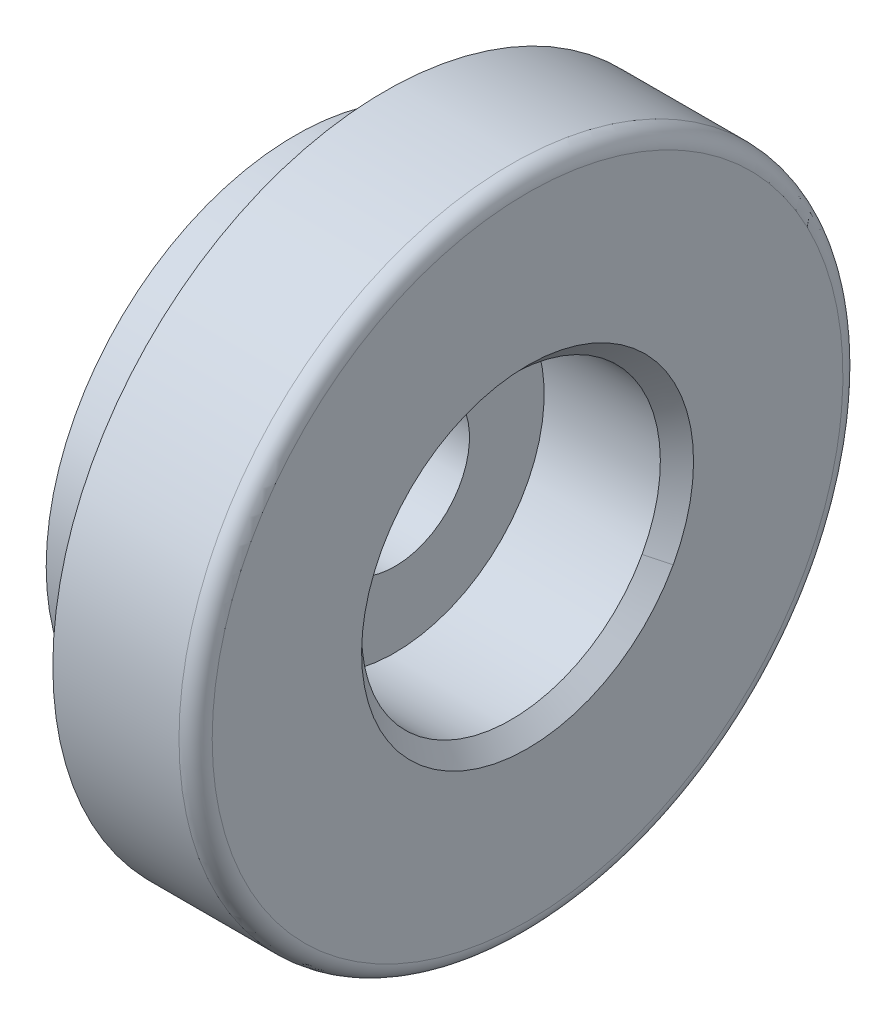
ISO-10303-21;
HEADER;
FILE_DESCRIPTION(('STEP AP214'),'2;1');
FILE_NAME('part.step','',(''),(''),'','','');
FILE_SCHEMA(('AUTOMOTIVE_DESIGN { 1 0 10303 214 1 1 1 1 }'));
ENDSEC;
DATA;
#1=APPLICATION_CONTEXT('core data for automotive mechanical design processes');
#2=APPLICATION_PROTOCOL_DEFINITION('international standard','automotive_design',2000,#1);
#3=PRODUCT_CONTEXT('',#1,'mechanical');
#4=PRODUCT('Part','Part','',(#3));
#5=PRODUCT_RELATED_PRODUCT_CATEGORY('part','',(#4));
#6=PRODUCT_DEFINITION_FORMATION('','',#4);
#7=PRODUCT_DEFINITION_CONTEXT('part definition',#1,'design');
#8=PRODUCT_DEFINITION('design','',#6,#7);
#9=PRODUCT_DEFINITION_SHAPE('','',#8);
#10=(LENGTH_UNIT() NAMED_UNIT(*) SI_UNIT(.MILLI.,.METRE.));
#11=(NAMED_UNIT(*) PLANE_ANGLE_UNIT() SI_UNIT($,.RADIAN.));
#12=(NAMED_UNIT(*) SI_UNIT($,.STERADIAN.) SOLID_ANGLE_UNIT());
#13=UNCERTAINTY_MEASURE_WITH_UNIT(LENGTH_MEASURE(1.E-05),#10,'distance_accuracy_value','');
#14=(GEOMETRIC_REPRESENTATION_CONTEXT(3) GLOBAL_UNCERTAINTY_ASSIGNED_CONTEXT((#13)) GLOBAL_UNIT_ASSIGNED_CONTEXT((#10,
#11,#12)) REPRESENTATION_CONTEXT('',''));
#15=CARTESIAN_POINT('',(0.,0.,0.));
#16=DIRECTION('',(0.,0.,1.));
#17=DIRECTION('',(1.,0.,0.));
#18=AXIS2_PLACEMENT_3D('',#15,#16,#17);
#19=CARTESIAN_POINT('',(0.,0.,2.25));
#20=DIRECTION('',(-1.,0.,0.));
#21=DIRECTION('',(0.,0.,1.));
#22=AXIS2_PLACEMENT_3D('',#19,#20,#21);
#23=PLANE('',#22);
#24=CARTESIAN_POINT('',(0.,0.,0.));
#25=DIRECTION('',(-1.,0.,0.));
#26=DIRECTION('',(0.,0.,1.));
#27=AXIS2_PLACEMENT_3D('',#24,#25,#26);
#28=CIRCLE('',#27,2.25);
#29=CARTESIAN_POINT('',(0.,0.,2.25));
#30=VERTEX_POINT('',#29);
#31=EDGE_CURVE('E180',#30,#30,#28,.F.);
#32=ORIENTED_EDGE('',*,*,#31,.T.);
#33=EDGE_LOOP('',(#32));
#34=FACE_BOUND('',#33,.T.);
#35=CARTESIAN_POINT('',(0.,0.,0.));
#36=DIRECTION('',(-1.,0.,0.));
#37=DIRECTION('',(0.,0.,1.));
#38=AXIS2_PLACEMENT_3D('',#35,#36,#37);
#39=CIRCLE('',#38,7.5);
#40=CARTESIAN_POINT('',(0.,0.,7.5));
#41=VERTEX_POINT('',#40);
#42=EDGE_CURVE('E183',#41,#41,#39,.F.);
#43=ORIENTED_EDGE('',*,*,#42,.F.);
#44=EDGE_LOOP('',(#43));
#45=FACE_BOUND('',#44,.T.);
#46=ADVANCED_FACE('F16',(#34,#45),#23,.T.);
#47=CARTESIAN_POINT('',(3.50000000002,0.,0.));
#48=DIRECTION('',(-1.,0.,0.));
#49=DIRECTION('',(0.,0.,1.));
#50=AXIS2_PLACEMENT_3D('',#47,#48,#49);
#51=CYLINDRICAL_SURFACE('',#50,7.5);
#52=CARTESIAN_POINT('',(2.7,0.,0.));
#53=DIRECTION('',(-1.,0.,0.));
#54=DIRECTION('',(0.,0.,1.));
#55=AXIS2_PLACEMENT_3D('',#52,#53,#54);
#56=CIRCLE('',#55,7.5);
#57=CARTESIAN_POINT('',(2.7,0.,7.5));
#58=VERTEX_POINT('',#57);
#59=EDGE_CURVE('E177',#58,#58,#56,.F.);
#60=ORIENTED_EDGE('',*,*,#59,.F.);
#61=EDGE_LOOP('',(#60));
#62=FACE_BOUND('',#61,.T.);
#63=ORIENTED_EDGE('',*,*,#42,.T.);
#64=EDGE_LOOP('',(#63));
#65=FACE_BOUND('',#64,.T.);
#66=ADVANCED_FACE('F104',(#62,#65),#51,.T.);
#67=CARTESIAN_POINT('',(3.50000000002,0.,0.));
#68=DIRECTION('',(-1.,0.,0.));
#69=DIRECTION('',(0.,0.,1.));
#70=AXIS2_PLACEMENT_3D('',#67,#68,#69);
#71=CYLINDRICAL_SURFACE('',#70,2.25);
#72=ORIENTED_EDGE('',*,*,#31,.F.);
#73=EDGE_LOOP('',(#72));
#74=FACE_BOUND('',#73,.T.);
#75=CARTESIAN_POINT('',(3.,0.,0.));
#76=DIRECTION('',(-1.,0.,0.));
#77=DIRECTION('',(0.,0.,1.));
#78=AXIS2_PLACEMENT_3D('',#75,#76,#77);
#79=CIRCLE('',#78,2.25);
#80=CARTESIAN_POINT('',(3.,0.,2.25));
#81=VERTEX_POINT('',#80);
#82=EDGE_CURVE('E174',#81,#81,#79,.F.);
#83=ORIENTED_EDGE('',*,*,#82,.T.);
#84=EDGE_LOOP('',(#83));
#85=FACE_BOUND('',#84,.T.);
#86=ADVANCED_FACE('F101',(#74,#85),#71,.F.);
#87=CARTESIAN_POINT('',(2.7,0.,7.5));
#88=DIRECTION('',(-1.,0.,0.));
#89=DIRECTION('',(0.,0.,1.));
#90=AXIS2_PLACEMENT_3D('',#87,#88,#89);
#91=PLANE('',#90);
#92=ORIENTED_EDGE('',*,*,#59,.T.);
#93=EDGE_LOOP('',(#92));
#94=FACE_BOUND('',#93,.T.);
#95=CARTESIAN_POINT('',(2.7,0.,0.));
#96=DIRECTION('',(-1.,0.,0.));
#97=DIRECTION('',(0.,0.,1.));
#98=AXIS2_PLACEMENT_3D('',#95,#96,#97);
#99=CIRCLE('',#98,10.);
#100=CARTESIAN_POINT('',(2.7,0.,10.));
#101=VERTEX_POINT('',#100);
#102=EDGE_CURVE('E166',#101,#101,#99,.F.);
#103=ORIENTED_EDGE('',*,*,#102,.F.);
#104=EDGE_LOOP('',(#103));
#105=FACE_BOUND('',#104,.T.);
#106=ADVANCED_FACE('F97',(#94,#105),#91,.T.);
#107=CARTESIAN_POINT('',(3.,0.,4.5));
#108=DIRECTION('',(-1.,0.,0.));
#109=DIRECTION('',(0.,0.,1.));
#110=AXIS2_PLACEMENT_3D('',#107,#108,#109);
#111=PLANE('',#110);
#112=ORIENTED_EDGE('',*,*,#82,.F.);
#113=EDGE_LOOP('',(#112));
#114=FACE_BOUND('',#113,.T.);
#115=CARTESIAN_POINT('',(3.,0.,0.));
#116=DIRECTION('',(-1.,0.,0.));
#117=DIRECTION('',(0.,0.,1.));
#118=AXIS2_PLACEMENT_3D('',#115,#116,#117);
#119=CIRCLE('',#118,4.5);
#120=CARTESIAN_POINT('',(3.,0.,4.5));
#121=VERTEX_POINT('',#120);
#122=EDGE_CURVE('E162',#121,#121,#119,.F.);
#123=ORIENTED_EDGE('',*,*,#122,.T.);
#124=EDGE_LOOP('',(#123));
#125=FACE_BOUND('',#124,.T.);
#126=ADVANCED_FACE('F93',(#114,#125),#111,.F.);
#127=CARTESIAN_POINT('',(3.50000000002,0.,0.));
#128=DIRECTION('',(-1.,0.,0.));
#129=DIRECTION('',(0.,0.,1.));
#130=AXIS2_PLACEMENT_3D('',#127,#128,#129);
#131=CYLINDRICAL_SURFACE('',#130,10.);
#132=ORIENTED_EDGE('',*,*,#102,.T.);
#133=EDGE_LOOP('',(#132));
#134=FACE_BOUND('',#133,.T.);
#135=CARTESIAN_POINT('',(6.5,0.,0.));
#136=DIRECTION('',(-1.,0.,0.));
#137=DIRECTION('',(0.,-0.197689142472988,-0.980264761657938));
#138=AXIS2_PLACEMENT_3D('',#135,#136,#137);
#139=CIRCLE('',#138,10.);
#140=CARTESIAN_POINT('',(6.5,-1.97689142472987,-9.80264761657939));
#141=VERTEX_POINT('',#140);
#142=EDGE_CURVE('E159',#141,#141,#139,.F.);
#143=ORIENTED_EDGE('',*,*,#142,.F.);
#144=EDGE_LOOP('',(#143));
#145=FACE_BOUND('',#144,.T.);
#146=ADVANCED_FACE('F89',(#134,#145),#131,.T.);
#147=CARTESIAN_POINT('',(3.50000000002,0.,0.));
#148=DIRECTION('',(-1.,0.,0.));
#149=DIRECTION('',(0.,0.,1.));
#150=AXIS2_PLACEMENT_3D('',#147,#148,#149);
#151=CYLINDRICAL_SURFACE('',#150,4.5);
#152=ORIENTED_EDGE('',*,*,#122,.F.);
#153=EDGE_LOOP('',(#152));
#154=FACE_BOUND('',#153,.T.);
#155=CARTESIAN_POINT('',(6.500000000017,0.,0.));
#156=DIRECTION('',(1.,0.,0.));
#157=DIRECTION('',(0.,-0.389180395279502,-0.921161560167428));
#158=AXIS2_PLACEMENT_3D('',#155,#156,#157);
#159=CIRCLE('',#158,4.49999999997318);
#160=CARTESIAN_POINT('',(6.50000000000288,2.15741492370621,3.94912152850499));
#161=VERTEX_POINT('',#160);
#162=CARTESIAN_POINT('',(6.49999999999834,-2.15741492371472,-3.94912152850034));
#163=VERTEX_POINT('',#162);
#164=EDGE_CURVE('E140',#161,#163,#159,.T.);
#165=ORIENTED_EDGE('',*,*,#164,.T.);
#166=CARTESIAN_POINT('',(6.49999999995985,0.,0.));
#167=DIRECTION('',(1.,0.,0.));
#168=DIRECTION('',(0.,0.479425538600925,0.877582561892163));
#169=AXIS2_PLACEMENT_3D('',#166,#167,#168);
#170=CIRCLE('',#169,4.50000000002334);
#171=EDGE_CURVE('E72',#163,#161,#170,.T.);
#172=ORIENTED_EDGE('',*,*,#171,.T.);
#173=EDGE_LOOP('',(#165,#172));
#174=FACE_BOUND('',#173,.T.);
#175=ADVANCED_FACE('F84',(#154,#174),#151,.F.);
#176=CARTESIAN_POINT('',(6.5,0.,0.));
#177=DIRECTION('',(-1.,0.,0.));
#178=DIRECTION('',(0.,-0.197689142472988,-0.980264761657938));
#179=AXIS2_PLACEMENT_3D('',#176,#177,#178);
#180=TOROIDAL_SURFACE('',#179,9.5,0.5);
#181=CARTESIAN_POINT('',(7.,4.55454261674,8.33703433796));
#182=CARTESIAN_POINT('',(7.,4.69095873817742,8.26251362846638));
#183=CARTESIAN_POINT('',(7.,4.82554242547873,8.18463925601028));
#184=CARTESIAN_POINT('',(7.,5.09072827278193,8.02238315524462));
#185=CARTESIAN_POINT('',(7.,5.22133043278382,7.93800142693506));
#186=CARTESIAN_POINT('',(7.,5.47823656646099,7.76293058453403));
#187=CARTESIAN_POINT('',(7.,5.60454054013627,7.67224147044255));
#188=CARTESIAN_POINT('',(7.,5.85254656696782,7.48477522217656));
#189=CARTESIAN_POINT('',(7.,5.97424862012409,7.38799808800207));
#190=CARTESIAN_POINT('',(7.,6.21275746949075,7.18858870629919));
#191=CARTESIAN_POINT('',(7.,6.32956426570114,7.08595645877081));
#192=CARTESIAN_POINT('',(7.,6.55800124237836,6.875084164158));
#193=CARTESIAN_POINT('',(7.,6.66963142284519,6.76684411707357));
#194=CARTESIAN_POINT('',(7.,6.88744623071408,6.54501696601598));
#195=CARTESIAN_POINT('',(7.,6.99363085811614,6.43142986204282));
#196=CARTESIAN_POINT('',(7.,7.20029875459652,6.19918224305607));
#197=CARTESIAN_POINT('',(7.,7.30078202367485,6.08052172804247));
#198=CARTESIAN_POINT('',(7.,7.49580512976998,5.83841314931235));
#199=CARTESIAN_POINT('',(7.,7.59034496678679,5.71496508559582));
#200=CARTESIAN_POINT('',(7.,7.77325345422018,5.46357880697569));
#201=CARTESIAN_POINT('',(7.,7.86162210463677,5.33564059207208));
#202=CARTESIAN_POINT('',(7.,8.03197533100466,5.07558222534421));
#203=CARTESIAN_POINT('',(7.,8.11395990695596,4.94346207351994));
#204=CARTESIAN_POINT('',(7.,8.2713474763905,4.67535812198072));
#205=CARTESIAN_POINT('',(7.,8.34675046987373,4.53937432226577));
#206=CARTESIAN_POINT('',(7.,8.49079322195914,4.26387067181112));
#207=CARTESIAN_POINT('',(7.,8.55943298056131,4.12435082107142));
#208=CARTESIAN_POINT('',(7.,8.68978390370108,3.84211118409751));
#209=CARTESIAN_POINT('',(7.,8.75149506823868,3.69939139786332));
#210=CARTESIAN_POINT('',(7.,8.86784013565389,3.41109571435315));
#211=CARTESIAN_POINT('',(7.,8.92247403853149,3.26551981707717));
#212=CARTESIAN_POINT('',(7.,9.0245329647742,2.97186261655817));
#213=CARTESIAN_POINT('',(7.,9.07195798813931,2.82378131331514));
#214=CARTESIAN_POINT('',(7.,9.159484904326,2.52547004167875));
#215=CARTESIAN_POINT('',(7.,9.19958679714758,2.37524007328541));
#216=CARTESIAN_POINT('',(7.,9.27237084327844,2.07299338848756));
#217=CARTESIAN_POINT('',(7.,9.30505299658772,1.92097667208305));
#218=CARTESIAN_POINT('',(7.,9.36291882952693,1.61552271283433));
#219=CARTESIAN_POINT('',(7.,9.38810250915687,1.46208546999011));
#220=CARTESIAN_POINT('',(7.,9.43091072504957,1.1541601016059));
#221=CARTESIAN_POINT('',(7.,9.44853526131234,0.999671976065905));
#222=CARTESIAN_POINT('',(7.,9.47618273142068,0.690017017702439));
#223=CARTESIAN_POINT('',(7.,9.48620566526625,0.534850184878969));
#224=CARTESIAN_POINT('',(7.,9.49862578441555,0.224211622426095));
#225=CARTESIAN_POINT('',(7.,9.50102296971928,0.068739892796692));
#226=CARTESIAN_POINT('',(7.,9.49818581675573,-0.242133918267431));
#227=CARTESIAN_POINT('',(7.,9.49295147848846,-0.397535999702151));
#228=CARTESIAN_POINT('',(7.,9.47486388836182,-0.707896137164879));
#229=CARTESIAN_POINT('',(7.,9.46201063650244,-0.862854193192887));
#230=CARTESIAN_POINT('',(7.,9.4287161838,-1.17195297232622));
#231=CARTESIAN_POINT('',(7.,9.40827498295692,-1.32609369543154));
#232=CARTESIAN_POINT('',(7.,9.35985387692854,-1.63318647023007));
#233=CARTESIAN_POINT('',(7.,9.33187397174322,-1.78613852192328));
#234=CARTESIAN_POINT('',(7.,9.26844286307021,-2.09048547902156));
#235=CARTESIAN_POINT('',(7.,9.23299165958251,-2.24188038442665));
#236=CARTESIAN_POINT('',(7.,9.15470335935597,-2.54274832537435));
#237=CARTESIAN_POINT('',(7.,9.11186626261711,-2.69222136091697));
#238=CARTESIAN_POINT('',(7.,9.01890937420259,-2.98888546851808));
#239=CARTESIAN_POINT('',(7.,8.96878958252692,-3.13607654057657));
#240=CARTESIAN_POINT('',(7.,8.86138804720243,-3.42782212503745));
#241=CARTESIAN_POINT('',(7.,8.80410630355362,-3.57237663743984));
#242=CARTESIAN_POINT('',(7.,8.68251886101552,-3.85850085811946));
#243=CARTESIAN_POINT('',(7.,8.61821316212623,-4.00007056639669));
#244=CARTESIAN_POINT('',(7.,8.48273272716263,-4.27988412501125));
#245=CARTESIAN_POINT('',(7.,8.41155799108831,-4.41812797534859));
#246=CARTESIAN_POINT('',(7.,8.26251094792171,-4.69095677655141));
#247=CARTESIAN_POINT('',(7.,8.18463864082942,-4.8255417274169));
#248=CARTESIAN_POINT('',(7.,8.0223840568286,-5.09072850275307));
#249=CARTESIAN_POINT('',(7.,7.93800177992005,-5.22133032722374));
#250=CARTESIAN_POINT('',(7.,7.7629305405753,-5.47823621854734));
#251=CARTESIAN_POINT('',(7.,7.6722415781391,-5.60454028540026));
#252=CARTESIAN_POINT('',(7.,7.48477544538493,-5.85254638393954));
#253=CARTESIAN_POINT('',(7.,7.38799827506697,-5.9742484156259));
#254=CARTESIAN_POINT('',(7.,7.18858887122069,-6.21275725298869));
#255=CARTESIAN_POINT('',(7.,7.08595663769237,-6.32956405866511));
#256=CARTESIAN_POINT('',(7.,6.87508435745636,-6.5580010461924));
#257=CARTESIAN_POINT('',(7.,6.76684431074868,-6.66963122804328));
#258=CARTESIAN_POINT('',(7.,6.5450171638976,-6.88744604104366));
#259=CARTESIAN_POINT('',(7.,6.43143006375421,-6.99363067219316));
#260=CARTESIAN_POINT('',(7.,6.19918245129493,-7.20029857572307));
#261=CARTESIAN_POINT('',(7.,6.08052193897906,-7.30078184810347));
#262=CARTESIAN_POINT('',(7.,5.83841336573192,-7.49580496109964));
#263=CARTESIAN_POINT('',(7.,5.71496530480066,-7.5903448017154));
#264=CARTESIAN_POINT('',(7.,5.46357903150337,-7.77325329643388));
#265=CARTESIAN_POINT('',(7.,5.33564081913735,-7.86162195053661));
#266=CARTESIAN_POINT('',(7.,5.07558245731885,-8.03197518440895));
#267=CARTESIAN_POINT('',(7.,4.94346230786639,-8.11395976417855));
#268=CARTESIAN_POINT('',(7.,4.6753583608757,-8.27134734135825));
#269=CARTESIAN_POINT('',(7.,4.53937456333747,-8.34675033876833));
#270=CARTESIAN_POINT('',(7.,4.26387091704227,-8.49079309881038));
#271=CARTESIAN_POINT('',(7.,4.12435106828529,-8.55943286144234));
#272=CARTESIAN_POINT('',(7.,3.84211143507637,-8.68978379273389));
#273=CARTESIAN_POINT('',(7.,3.69939165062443,-8.75149496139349));
#274=CARTESIAN_POINT('',(7.,3.41109597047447,-8.86784003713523));
#275=CARTESIAN_POINT('',(7.,3.26552007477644,-8.92247394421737));
#276=CARTESIAN_POINT('',(7.,2.97186287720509,-9.02453287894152));
#277=CARTESIAN_POINT('',(7.,2.82378157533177,-9.07195790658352));
#278=CARTESIAN_POINT('',(7.,2.52547030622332,-9.15948483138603));
#279=CARTESIAN_POINT('',(7.,2.37524033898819,-9.19958672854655));
#280=CARTESIAN_POINT('',(7.,2.07299365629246,-9.27237078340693));
#281=CARTESIAN_POINT('',(7.,1.92097694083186,-9.30505294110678));
#282=CARTESIAN_POINT('',(7.,1.61552298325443,-9.36291878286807));
#283=CARTESIAN_POINT('',(7.,1.46208574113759,-9.38810246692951));
#284=CARTESIAN_POINT('',(7.,1.15416037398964,-9.43091069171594));
#285=CARTESIAN_POINT('',(7.,0.999672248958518,-9.44853523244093));
#286=CARTESIAN_POINT('',(7.,0.690017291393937,-9.47618271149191));
#287=CARTESIAN_POINT('',(7.,0.534850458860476,-9.48620564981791));
#288=CARTESIAN_POINT('',(7.,0.224211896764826,-9.49862577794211));
#289=CARTESIAN_POINT('',(7.,0.0687401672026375,-9.50102296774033));
#290=CARTESIAN_POINT('',(7.,-0.242133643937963,-9.49818582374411));
#291=CARTESIAN_POINT('',(7.,-0.397535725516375,-9.49295148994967));
#292=CARTESIAN_POINT('',(7.,-0.707895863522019,-9.47486390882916));
#293=CARTESIAN_POINT('',(7.,-0.862853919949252,-9.46201066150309));
#294=CARTESIAN_POINT('',(7.,-1.17195269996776,-9.42871621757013));
#295=CARTESIAN_POINT('',(7.,-1.32609342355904,-9.40827502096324));
#296=CARTESIAN_POINT('',(7.,-1.63318620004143,-9.35985392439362));
#297=CARTESIAN_POINT('',(7.,-1.78613825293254,-9.3318740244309));
#298=CARTESIAN_POINT('',(7.,-2.09048521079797,-9.26844292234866));
#299=CARTESIAN_POINT('',(7.,-2.2418801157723,-9.23299172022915));
#300=CARTESIAN_POINT('',(7.,-2.54274806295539,-9.15470343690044));
#301=CARTESIAN_POINT('',(7.,-2.69222110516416,-9.11186635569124));
#302=CARTESIAN_POINT('',(7.,-2.98888520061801,-9.01890944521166));
#303=CARTESIAN_POINT('',(7.,-3.13607625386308,-8.96878961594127));
#304=CARTESIAN_POINT('',(7.,-3.42782189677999,-8.86138820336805));
#305=CARTESIAN_POINT('',(7.,-3.57237648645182,-8.80410662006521));
#306=CARTESIAN_POINT('',(7.,-3.85850050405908,-8.68251875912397));
#307=CARTESIAN_POINT('',(7.,-4.00006993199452,-8.61821248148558));
#308=CARTESIAN_POINT('',(7.,-4.27988426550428,-8.48273364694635));
#309=CARTESIAN_POINT('',(7.,-4.4181291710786,-8.41156109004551));
#310=CARTESIAN_POINT('',(7.,-4.55454213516,-8.33703460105));
#311=B_SPLINE_CURVE_WITH_KNOTS('',3,(#181,#182,#183,#184,#185,#186,#187,#188,#189,#190,#191,
#192,#193,#194,#195,#196,#197,#198,#199,#200,#201,#202,#203,#204,#205,#206,#207,#208,#209,#210,
#211,#212,#213,#214,#215,#216,#217,#218,#219,#220,#221,#222,#223,#224,#225,#226,#227,#228,#229,
#230,#231,#232,#233,#234,#235,#236,#237,#238,#239,#240,#241,#242,#243,#244,#245,#246,#247,#248,
#249,#250,#251,#252,#253,#254,#255,#256,#257,#258,#259,#260,#261,#262,#263,#264,#265,#266,#267,
#268,#269,#270,#271,#272,#273,#274,#275,#276,#277,#278,#279,#280,#281,#282,#283,#284,#285,#286,
#287,#288,#289,#290,#291,#292,#293,#294,#295,#296,#297,#298,#299,#300,#301,#302,#303,#304,#305,
#306,#307,#308,#309,#310),.UNSPECIFIED.,.F.,.F.,(4,2,2,2,2,2,2,2,2,2,2,2,2,2,2,2,2,2,2,2,2,2,2,
2,2,2,2,2,2,2,2,2,2,2,2,2,2,2,2,2,2,2,2,2,2,2,2,2,2,2,2,2,2,2,2,2,2,2,2,2,2,2,2,2,4),(0.,
0.466283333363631,0.932566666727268,1.3988500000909,1.86513333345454,2.33141666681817,
2.79770000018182,3.26398333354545,3.73026666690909,4.19655000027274,4.66283333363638,
5.12911666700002,5.59540000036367,6.06168333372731,6.52796666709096,6.99425000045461,
7.46053333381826,7.92681666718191,8.39310000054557,8.85938333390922,9.32566666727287,
9.79195000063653,10.2582333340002,10.7245166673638,11.1908000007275,11.6570833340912,
12.1233666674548,12.5896500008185,13.0559333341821,13.5222166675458,13.9885000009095,
14.4547833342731,14.9210666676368,15.3873500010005,15.8536333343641,16.3199166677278,
16.7862000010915,17.2524833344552,17.7187666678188,18.1850500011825,18.6513333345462,
19.1176166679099,19.5839000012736,20.0501833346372,20.5164666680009,20.9827500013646,
21.4490333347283,21.915316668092,22.3816000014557,22.8478833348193,23.314166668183,
23.7804500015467,24.2467333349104,24.7130166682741,25.1793000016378,25.6455833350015,
26.1118666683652,26.5781500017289,27.0444333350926,27.5107166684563,27.97700000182,
28.4432833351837,28.9095666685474,29.3758500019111,29.8421333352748),.UNSPECIFIED.);
#312=CARTESIAN_POINT('',(7.,4.55454261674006,8.33703433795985));
#313=VERTEX_POINT('',#312);
#314=CARTESIAN_POINT('',(7.,-4.55454232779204,-8.33703449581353));
#315=VERTEX_POINT('',#314);
#316=EDGE_CURVE('E53',#313,#315,#311,.T.);
#317=ORIENTED_EDGE('',*,*,#316,.T.);
#318=CARTESIAN_POINT('',(7.,0.,0.));
#319=DIRECTION('',(-1.,0.,0.));
#320=DIRECTION('',(0.,-0.479425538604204,-0.877582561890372));
#321=AXIS2_PLACEMENT_3D('',#318,#319,#320);
#322=CIRCLE('',#321,9.50000000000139);
#323=EDGE_CURVE('E57',#315,#313,#322,.T.);
#324=ORIENTED_EDGE('',*,*,#323,.T.);
#325=EDGE_LOOP('',(#317,#324));
#326=FACE_BOUND('',#325,.T.);
#327=ORIENTED_EDGE('',*,*,#142,.T.);
#328=EDGE_LOOP('',(#327));
#329=FACE_BOUND('',#328,.T.);
#330=ADVANCED_FACE('F63',(#326,#329),#180,.T.);
#331=CARTESIAN_POINT('',(6.99999999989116,0.,0.));
#332=DIRECTION('',(1.,0.,0.));
#333=DIRECTION('',(0.,0.,-1.));
#334=AXIS2_PLACEMENT_3D('',#331,#332,#333);
#335=CONICAL_SURFACE('',#334,4.99999999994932,0.785398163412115);
#336=ORIENTED_EDGE('',*,*,#171,.F.);
#337=CARTESIAN_POINT('',(6.50000000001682,-2.1574149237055,-3.94912152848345));
#338=CARTESIAN_POINT('',(6.52083333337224,-2.1674029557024,-3.96740449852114));
#339=CARTESIAN_POINT('',(6.54166666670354,-2.17739098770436,-3.98568746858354));
#340=CARTESIAN_POINT('',(6.58333333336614,-2.19736705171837,-4.02225340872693));
#341=CARTESIAN_POINT('',(6.60416666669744,-2.20735508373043,-4.0405363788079));
#342=CARTESIAN_POINT('',(6.6458333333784,-2.22733114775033,-4.07710231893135));
#343=CARTESIAN_POINT('',(6.66666666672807,-2.23731917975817,-4.09538528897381));
#344=CARTESIAN_POINT('',(6.70833333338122,-2.25729524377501,-4.13195122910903));
#345=CARTESIAN_POINT('',(6.7291666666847,-2.26728327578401,-4.15023419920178));
#346=CARTESIAN_POINT('',(6.77083333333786,-2.28725933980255,-4.18680013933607));
#347=CARTESIAN_POINT('',(6.79166666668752,-2.29724737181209,-4.20508310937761));
#348=CARTESIAN_POINT('',(6.83333333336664,-2.31722343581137,-4.24164904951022));
#349=CARTESIAN_POINT('',(6.85416666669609,-2.32721146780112,-4.25993201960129));
#350=CARTESIAN_POINT('',(6.89583333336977,-2.34718753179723,-4.29649795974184));
#351=CARTESIAN_POINT('',(6.91666666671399,-2.3571755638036,-4.31478092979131));
#352=CARTESIAN_POINT('',(6.95833333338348,-2.37715162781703,-4.35134686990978));
#353=CARTESIAN_POINT('',(6.97916666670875,-2.38713965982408,-4.36962983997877));
#354=CARTESIAN_POINT('',(7.000000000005,-2.3971276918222,-4.38791281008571));
#355=B_SPLINE_CURVE_WITH_KNOTS('',3,(#337,#338,#339,#340,#341,#342,#343,#344,#345,#346,#347,
#348,#349,#350,#351,#352,#353,#354),.UNSPECIFIED.,.F.,.F.,(4,2,2,2,2,2,2,2,4),(0.,
0.08838834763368,0.176776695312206,0.265165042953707,0.353553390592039,0.44194173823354,
0.530330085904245,0.618718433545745,0.707106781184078),.UNSPECIFIED.);
#356=CARTESIAN_POINT('',(6.999999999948,-2.39712769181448,-4.38791281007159));
#357=VERTEX_POINT('',#356);
#358=EDGE_CURVE('E60',#163,#357,#355,.T.);
#359=ORIENTED_EDGE('',*,*,#358,.T.);
#360=CARTESIAN_POINT('',(6.99999999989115,0.,0.));
#361=DIRECTION('',(1.,0.,0.));
#362=DIRECTION('',(0.,0.,-1.));
#363=AXIS2_PLACEMENT_3D('',#360,#361,#362);
#364=CIRCLE('',#363,4.99999999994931);
#365=CARTESIAN_POINT('',(7.0000000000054,2.39712769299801,4.38791280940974));
#366=VERTEX_POINT('',#365);
#367=EDGE_CURVE('E26',#357,#366,#364,.T.);
#368=ORIENTED_EDGE('',*,*,#367,.T.);
#369=CARTESIAN_POINT('',(7.0000000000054,2.39712769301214,4.3879128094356));
#370=CARTESIAN_POINT('',(6.97916666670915,2.38713966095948,4.36962983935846));
#371=CARTESIAN_POINT('',(6.95833333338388,2.37715162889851,4.35134686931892));
#372=CARTESIAN_POINT('',(6.91666666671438,2.35717556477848,4.3147809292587));
#373=CARTESIAN_POINT('',(6.89583333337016,2.34718753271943,4.296497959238));
#374=CARTESIAN_POINT('',(6.85416666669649,2.3272114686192,4.25993201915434));
#375=CARTESIAN_POINT('',(6.83333333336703,2.31722343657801,4.24164904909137));
#376=CARTESIAN_POINT('',(6.79166666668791,2.29724737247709,4.20508310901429));
#377=CARTESIAN_POINT('',(6.77083333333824,2.28725934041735,4.18680013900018));
#378=CARTESIAN_POINT('',(6.72916666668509,2.26728327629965,4.15023419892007));
#379=CARTESIAN_POINT('',(6.7083333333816,2.25729524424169,4.13195122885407));
#380=CARTESIAN_POINT('',(6.66666666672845,2.23731918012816,4.09538528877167));
#381=CARTESIAN_POINT('',(6.64583333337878,2.2273311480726,4.07710231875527));
#382=CARTESIAN_POINT('',(6.60416666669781,2.2073550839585,4.0405363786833));
#383=CARTESIAN_POINT('',(6.58333333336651,2.19736705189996,4.02225340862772));
#384=CARTESIAN_POINT('',(6.5416666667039,2.17739098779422,3.98568746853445));
#385=CARTESIAN_POINT('',(6.5208333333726,2.16740295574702,3.96740449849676));
#386=CARTESIAN_POINT('',(6.50000000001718,2.1574149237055,3.94912152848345));
#387=B_SPLINE_CURVE_WITH_KNOTS('',3,(#369,#370,#371,#372,#373,#374,#375,#376,#377,#378,#379,
#380,#381,#382,#383,#384,#385,#386),.UNSPECIFIED.,.F.,.F.,(4,2,2,2,2,2,2,2,4),(0.,
0.0883883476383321,0.176776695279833,0.265165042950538,0.35355339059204,0.441941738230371,
0.530330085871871,0.618718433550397,0.707106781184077),.UNSPECIFIED.);
#388=EDGE_CURVE('E33',#366,#161,#387,.T.);
#389=ORIENTED_EDGE('',*,*,#388,.T.);
#390=EDGE_LOOP('',(#336,#359,#368,#389));
#391=FACE_BOUND('',#390,.T.);
#392=ADVANCED_FACE('F83',(#391),#335,.F.);
#393=CARTESIAN_POINT('',(6.99999999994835,0.,0.));
#394=DIRECTION('',(1.,0.,0.));
#395=DIRECTION('',(0.,1.,0.));
#396=AXIS2_PLACEMENT_3D('',#393,#394,#395);
#397=CONICAL_SURFACE('',#396,4.99999999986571,0.78539816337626);
#398=ORIENTED_EDGE('',*,*,#164,.F.);
#399=ORIENTED_EDGE('',*,*,#388,.F.);
#400=CARTESIAN_POINT('',(7.0000000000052,0.,0.));
#401=DIRECTION('',(1.,0.,0.));
#402=DIRECTION('',(0.,1.,0.));
#403=AXIS2_PLACEMENT_3D('',#400,#401,#402);
#404=CIRCLE('',#403,4.99999999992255);
#405=EDGE_CURVE('E11',#366,#357,#404,.T.);
#406=ORIENTED_EDGE('',*,*,#405,.T.);
#407=ORIENTED_EDGE('',*,*,#358,.F.);
#408=EDGE_LOOP('',(#398,#399,#406,#407));
#409=FACE_BOUND('',#408,.T.);
#410=ADVANCED_FACE('F117',(#409),#397,.F.);
#411=CARTESIAN_POINT('',(7.,0.,10.));
#412=DIRECTION('',(-1.,0.,0.));
#413=DIRECTION('',(0.,0.,1.));
#414=AXIS2_PLACEMENT_3D('',#411,#412,#413);
#415=PLANE('',#414);
#416=ORIENTED_EDGE('',*,*,#367,.F.);
#417=ORIENTED_EDGE('',*,*,#405,.F.);
#418=EDGE_LOOP('',(#416,#417));
#419=FACE_BOUND('',#418,.T.);
#420=ORIENTED_EDGE('',*,*,#316,.F.);
#421=ORIENTED_EDGE('',*,*,#323,.F.);
#422=EDGE_LOOP('',(#420,#421));
#423=FACE_BOUND('',#422,.T.);
#424=ADVANCED_FACE('F56',(#419,#423),#415,.F.);
#425=CLOSED_SHELL('',(#46,#66,#86,#106,#126,#146,#175,#330,#392,#410,#424));
#426=MANIFOLD_SOLID_BREP('B1',#425);
#427=ADVANCED_BREP_SHAPE_REPRESENTATION('',(#18,#426),#14);
#428=SHAPE_DEFINITION_REPRESENTATION(#9,#427);
ENDSEC;
END-ISO-10303-21;
